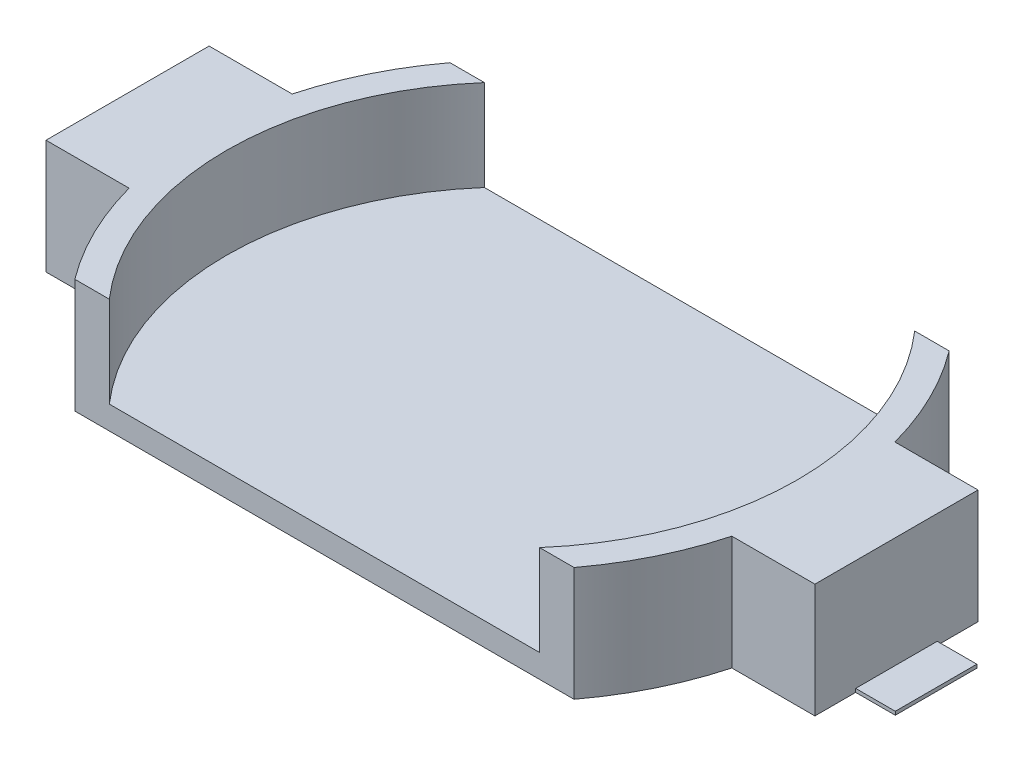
ISO-10303-21;
HEADER;
FILE_DESCRIPTION(('STEP AP214'),'2;1');
FILE_NAME('part.step','',(''),(''),'','','');
FILE_SCHEMA(('AUTOMOTIVE_DESIGN { 1 0 10303 214 1 1 1 1 }'));
ENDSEC;
DATA;
#1=APPLICATION_CONTEXT('core data for automotive mechanical design processes');
#2=APPLICATION_PROTOCOL_DEFINITION('international standard','automotive_design',2000,#1);
#3=PRODUCT_CONTEXT('',#1,'mechanical');
#4=PRODUCT('Part','Part','',(#3));
#5=PRODUCT_RELATED_PRODUCT_CATEGORY('part','',(#4));
#6=PRODUCT_DEFINITION_FORMATION('','',#4);
#7=PRODUCT_DEFINITION_CONTEXT('part definition',#1,'design');
#8=PRODUCT_DEFINITION('design','',#6,#7);
#9=PRODUCT_DEFINITION_SHAPE('','',#8);
#10=(LENGTH_UNIT() NAMED_UNIT(*) SI_UNIT(.MILLI.,.METRE.));
#11=(NAMED_UNIT(*) PLANE_ANGLE_UNIT() SI_UNIT($,.RADIAN.));
#12=(NAMED_UNIT(*) SI_UNIT($,.STERADIAN.) SOLID_ANGLE_UNIT());
#13=UNCERTAINTY_MEASURE_WITH_UNIT(LENGTH_MEASURE(1.E-05),#10,'distance_accuracy_value','');
#14=(GEOMETRIC_REPRESENTATION_CONTEXT(3) GLOBAL_UNCERTAINTY_ASSIGNED_CONTEXT((#13)) GLOBAL_UNIT_ASSIGNED_CONTEXT((#10,
#11,#12)) REPRESENTATION_CONTEXT('',''));
#15=CARTESIAN_POINT('',(0.,0.,0.));
#16=DIRECTION('',(0.,0.,1.));
#17=DIRECTION('',(1.,0.,0.));
#18=AXIS2_PLACEMENT_3D('',#15,#16,#17);
#19=CARTESIAN_POINT('',(0.,4.9,0.));
#20=DIRECTION('',(0.,-1.,0.));
#21=DIRECTION('',(0.,0.,-1.));
#22=AXIS2_PLACEMENT_3D('',#19,#20,#21);
#23=CYLINDRICAL_SURFACE('',#22,13.4);
#24=CARTESIAN_POINT('',(0.,4.9,0.));
#25=DIRECTION('',(0.,1.,0.));
#26=DIRECTION('',(0.,0.,1.));
#27=AXIS2_PLACEMENT_3D('',#24,#25,#26);
#28=CIRCLE('',#27,13.4);
#29=CARTESIAN_POINT('',(12.9348366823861,4.9,-3.5));
#30=VERTEX_POINT('',#29);
#31=CARTESIAN_POINT('',(10.7124927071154,4.9,-8.05));
#32=VERTEX_POINT('',#31);
#33=EDGE_CURVE('E357',#30,#32,#28,.T.);
#34=ORIENTED_EDGE('',*,*,#33,.F.);
#35=DIRECTION('',(0.,-1.,0.));
#36=VECTOR('',#35,1.);
#37=CARTESIAN_POINT('',(12.9348366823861,4.9,-3.5));
#38=LINE('',#37,#36);
#39=CARTESIAN_POINT('',(12.9348366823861,0.,-3.5));
#40=VERTEX_POINT('',#39);
#41=EDGE_CURVE('E322',#30,#40,#38,.T.);
#42=ORIENTED_EDGE('',*,*,#41,.T.);
#43=CARTESIAN_POINT('',(0.,0.,0.));
#44=DIRECTION('',(0.,1.,0.));
#45=DIRECTION('',(0.,0.,1.));
#46=AXIS2_PLACEMENT_3D('',#43,#44,#45);
#47=CIRCLE('',#46,13.4);
#48=CARTESIAN_POINT('',(10.7124927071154,0.,-8.05));
#49=VERTEX_POINT('',#48);
#50=EDGE_CURVE('E353',#40,#49,#47,.T.);
#51=ORIENTED_EDGE('',*,*,#50,.T.);
#52=DIRECTION('',(0.,-1.,0.));
#53=VECTOR('',#52,1.);
#54=CARTESIAN_POINT('',(10.7124927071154,4.9,-8.05));
#55=LINE('',#54,#53);
#56=EDGE_CURVE('E370',#32,#49,#55,.T.);
#57=ORIENTED_EDGE('',*,*,#56,.F.);
#58=EDGE_LOOP('',(#34,#42,#51,#57));
#59=FACE_BOUND('',#58,.T.);
#60=ADVANCED_FACE('F31',(#59),#23,.T.);
#61=CARTESIAN_POINT('',(-12.9348366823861,4.9,3.50000000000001));
#62=VERTEX_POINT('',#61);
#63=CARTESIAN_POINT('',(-10.7124927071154,4.9,8.05));
#64=VERTEX_POINT('',#63);
#65=EDGE_CURVE('E352',#62,#64,#28,.T.);
#66=ORIENTED_EDGE('',*,*,#65,.F.);
#67=DIRECTION('',(0.,-1.,0.));
#68=VECTOR('',#67,1.);
#69=CARTESIAN_POINT('',(-12.9348366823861,4.9,3.5));
#70=LINE('',#69,#68);
#71=CARTESIAN_POINT('',(-12.9348366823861,0.,3.5));
#72=VERTEX_POINT('',#71);
#73=EDGE_CURVE('E403',#62,#72,#70,.T.);
#74=ORIENTED_EDGE('',*,*,#73,.T.);
#75=CARTESIAN_POINT('',(-10.7124927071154,0.,8.05));
#76=VERTEX_POINT('',#75);
#77=EDGE_CURVE('E367',#72,#76,#47,.T.);
#78=ORIENTED_EDGE('',*,*,#77,.T.);
#79=DIRECTION('',(0.,-1.,0.));
#80=VECTOR('',#79,1.);
#81=CARTESIAN_POINT('',(-10.7124927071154,4.9,8.05));
#82=LINE('',#81,#80);
#83=EDGE_CURVE('E385',#64,#76,#82,.T.);
#84=ORIENTED_EDGE('',*,*,#83,.F.);
#85=EDGE_LOOP('',(#66,#74,#78,#84));
#86=FACE_BOUND('',#85,.T.);
#87=ADVANCED_FACE('F433',(#86),#23,.T.);
#88=CARTESIAN_POINT('',(10.7124927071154,0.,8.05));
#89=VERTEX_POINT('',#88);
#90=CARTESIAN_POINT('',(12.9348366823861,0.,3.5));
#91=VERTEX_POINT('',#90);
#92=EDGE_CURVE('E350',#89,#91,#47,.T.);
#93=ORIENTED_EDGE('',*,*,#92,.T.);
#94=DIRECTION('',(0.,-1.,0.));
#95=VECTOR('',#94,1.);
#96=CARTESIAN_POINT('',(12.9348366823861,4.9,3.5));
#97=LINE('',#96,#95);
#98=CARTESIAN_POINT('',(12.9348366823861,4.9,3.5));
#99=VERTEX_POINT('',#98);
#100=EDGE_CURVE('E327',#99,#91,#97,.T.);
#101=ORIENTED_EDGE('',*,*,#100,.F.);
#102=CARTESIAN_POINT('',(10.7124927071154,4.9,8.05));
#103=VERTEX_POINT('',#102);
#104=EDGE_CURVE('E349',#103,#99,#28,.T.);
#105=ORIENTED_EDGE('',*,*,#104,.F.);
#106=DIRECTION('',(0.,-1.,0.));
#107=VECTOR('',#106,1.);
#108=CARTESIAN_POINT('',(10.7124927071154,4.9,8.05));
#109=LINE('',#108,#107);
#110=EDGE_CURVE('E388',#89,#103,#109,.F.);
#111=ORIENTED_EDGE('',*,*,#110,.F.);
#112=EDGE_LOOP('',(#93,#101,#105,#111));
#113=FACE_BOUND('',#112,.T.);
#114=ADVANCED_FACE('F33',(#113),#23,.T.);
#115=CARTESIAN_POINT('',(-10.7124927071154,0.,-8.05));
#116=VERTEX_POINT('',#115);
#117=CARTESIAN_POINT('',(-12.9348366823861,0.,-3.5));
#118=VERTEX_POINT('',#117);
#119=EDGE_CURVE('E354',#116,#118,#47,.T.);
#120=ORIENTED_EDGE('',*,*,#119,.T.);
#121=DIRECTION('',(0.,-1.,0.));
#122=VECTOR('',#121,1.);
#123=CARTESIAN_POINT('',(-12.9348366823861,4.9,-3.5));
#124=LINE('',#123,#122);
#125=CARTESIAN_POINT('',(-12.9348366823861,4.9,-3.5));
#126=VERTEX_POINT('',#125);
#127=EDGE_CURVE('E400',#126,#118,#124,.T.);
#128=ORIENTED_EDGE('',*,*,#127,.F.);
#129=CARTESIAN_POINT('',(-10.7124927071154,4.9,-8.05));
#130=VERTEX_POINT('',#129);
#131=EDGE_CURVE('E358',#130,#126,#28,.T.);
#132=ORIENTED_EDGE('',*,*,#131,.F.);
#133=DIRECTION('',(0.,-1.,0.));
#134=VECTOR('',#133,1.);
#135=CARTESIAN_POINT('',(-10.7124927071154,4.9,-8.05));
#136=LINE('',#135,#134);
#137=EDGE_CURVE('E373',#116,#130,#136,.F.);
#138=ORIENTED_EDGE('',*,*,#137,.F.);
#139=EDGE_LOOP('',(#120,#128,#132,#138));
#140=FACE_BOUND('',#139,.T.);
#141=ADVANCED_FACE('F416',(#140),#23,.T.);
#142=CARTESIAN_POINT('',(0.,4.9,0.));
#143=DIRECTION('',(0.,1.,0.));
#144=DIRECTION('',(0.,0.,1.));
#145=AXIS2_PLACEMENT_3D('',#142,#143,#144);
#146=PLANE('',#145);
#147=ORIENTED_EDGE('',*,*,#104,.T.);
#148=DIRECTION('',(-1.,0.,0.));
#149=VECTOR('',#148,1.);
#150=CARTESIAN_POINT('',(16.5,4.9,3.5));
#151=LINE('',#150,#149);
#152=CARTESIAN_POINT('',(16.5,4.9,3.5));
#153=VERTEX_POINT('',#152);
#154=EDGE_CURVE('E268',#153,#99,#151,.T.);
#155=ORIENTED_EDGE('',*,*,#154,.F.);
#156=DIRECTION('',(0.,0.,1.));
#157=VECTOR('',#156,1.);
#158=CARTESIAN_POINT('',(16.5,4.9,3.5));
#159=LINE('',#158,#157);
#160=CARTESIAN_POINT('',(16.5,4.9,-3.5));
#161=VERTEX_POINT('',#160);
#162=EDGE_CURVE('E265',#161,#153,#159,.T.);
#163=ORIENTED_EDGE('',*,*,#162,.F.);
#164=DIRECTION('',(1.,0.,0.));
#165=VECTOR('',#164,1.);
#166=CARTESIAN_POINT('',(16.5,4.9,-3.5));
#167=LINE('',#166,#165);
#168=EDGE_CURVE('E272',#30,#161,#167,.T.);
#169=ORIENTED_EDGE('',*,*,#168,.F.);
#170=ORIENTED_EDGE('',*,*,#33,.T.);
#171=DIRECTION('',(-1.,0.,0.));
#172=VECTOR('',#171,1.);
#173=CARTESIAN_POINT('',(0.,4.9,-8.05));
#174=LINE('',#173,#172);
#175=CARTESIAN_POINT('',(9.23363417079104,4.9,-8.05));
#176=VERTEX_POINT('',#175);
#177=EDGE_CURVE('E375',#32,#176,#174,.T.);
#178=ORIENTED_EDGE('',*,*,#177,.T.);
#179=CARTESIAN_POINT('',(0.,4.9,0.));
#180=DIRECTION('',(0.,1.,0.));
#181=DIRECTION('',(0.,0.,1.));
#182=AXIS2_PLACEMENT_3D('',#179,#180,#181);
#183=CIRCLE('',#182,12.25);
#184=CARTESIAN_POINT('',(9.23363417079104,4.9,8.05));
#185=VERTEX_POINT('',#184);
#186=EDGE_CURVE('E359',#185,#176,#183,.T.);
#187=ORIENTED_EDGE('',*,*,#186,.F.);
#188=DIRECTION('',(1.,0.,0.));
#189=VECTOR('',#188,1.);
#190=CARTESIAN_POINT('',(0.,4.9,8.05));
#191=LINE('',#190,#189);
#192=EDGE_CURVE('E391',#185,#103,#191,.T.);
#193=ORIENTED_EDGE('',*,*,#192,.T.);
#194=EDGE_LOOP('',(#147,#155,#163,#169,#170,#178,#187,#193));
#195=FACE_BOUND('',#194,.T.);
#196=ADVANCED_FACE('F445',(#195),#146,.T.);
#197=ORIENTED_EDGE('',*,*,#131,.T.);
#198=DIRECTION('',(1.,0.,0.));
#199=VECTOR('',#198,1.);
#200=CARTESIAN_POINT('',(-16.5,4.9,-3.5));
#201=LINE('',#200,#199);
#202=CARTESIAN_POINT('',(-16.5,4.9,-3.5));
#203=VERTEX_POINT('',#202);
#204=EDGE_CURVE('E336',#203,#126,#201,.T.);
#205=ORIENTED_EDGE('',*,*,#204,.F.);
#206=DIRECTION('',(0.,0.,-1.));
#207=VECTOR('',#206,1.);
#208=CARTESIAN_POINT('',(-16.5,4.9,3.5));
#209=LINE('',#208,#207);
#210=CARTESIAN_POINT('',(-16.5,4.9,3.5));
#211=VERTEX_POINT('',#210);
#212=EDGE_CURVE('E334',#211,#203,#209,.T.);
#213=ORIENTED_EDGE('',*,*,#212,.F.);
#214=DIRECTION('',(-1.,0.,0.));
#215=VECTOR('',#214,1.);
#216=CARTESIAN_POINT('',(-16.5,4.9,3.5));
#217=LINE('',#216,#215);
#218=EDGE_CURVE('E340',#62,#211,#217,.T.);
#219=ORIENTED_EDGE('',*,*,#218,.F.);
#220=ORIENTED_EDGE('',*,*,#65,.T.);
#221=CARTESIAN_POINT('',(-9.23363417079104,4.9,8.05));
#222=VERTEX_POINT('',#221);
#223=EDGE_CURVE('E390',#64,#222,#191,.T.);
#224=ORIENTED_EDGE('',*,*,#223,.T.);
#225=CARTESIAN_POINT('',(-9.23363417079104,4.9,-8.05));
#226=VERTEX_POINT('',#225);
#227=EDGE_CURVE('E363',#226,#222,#183,.T.);
#228=ORIENTED_EDGE('',*,*,#227,.F.);
#229=EDGE_CURVE('E376',#226,#130,#174,.T.);
#230=ORIENTED_EDGE('',*,*,#229,.T.);
#231=EDGE_LOOP('',(#197,#205,#213,#219,#220,#224,#228,#230));
#232=FACE_BOUND('',#231,.T.);
#233=ADVANCED_FACE('F419',(#232),#146,.T.);
#234=CARTESIAN_POINT('',(0.,0.,0.));
#235=DIRECTION('',(0.,1.,0.));
#236=DIRECTION('',(0.,0.,1.));
#237=AXIS2_PLACEMENT_3D('',#234,#235,#236);
#238=PLANE('',#237);
#239=ORIENTED_EDGE('',*,*,#50,.F.);
#240=DIRECTION('',(1.,0.,0.));
#241=VECTOR('',#240,1.);
#242=CARTESIAN_POINT('',(16.5,0.,-3.5));
#243=LINE('',#242,#241);
#244=CARTESIAN_POINT('',(16.5,0.,-3.5));
#245=VERTEX_POINT('',#244);
#246=EDGE_CURVE('E269',#40,#245,#243,.T.);
#247=ORIENTED_EDGE('',*,*,#246,.T.);
#248=DIRECTION('',(0.,0.,1.));
#249=VECTOR('',#248,1.);
#250=CARTESIAN_POINT('',(16.5,0.,3.5));
#251=LINE('',#250,#249);
#252=CARTESIAN_POINT('',(16.5,0.,-1.75));
#253=VERTEX_POINT('',#252);
#254=EDGE_CURVE('E284',#245,#253,#251,.T.);
#255=ORIENTED_EDGE('',*,*,#254,.T.);
#256=DIRECTION('',(1.,0.,0.));
#257=VECTOR('',#256,1.);
#258=CARTESIAN_POINT('',(16.5,0.,-1.75));
#259=LINE('',#258,#257);
#260=CARTESIAN_POINT('',(18.2,0.,-1.75));
#261=VERTEX_POINT('',#260);
#262=EDGE_CURVE('E48',#253,#261,#259,.T.);
#263=ORIENTED_EDGE('',*,*,#262,.T.);
#264=DIRECTION('',(0.,0.,1.));
#265=VECTOR('',#264,1.);
#266=CARTESIAN_POINT('',(18.2,0.,1.75));
#267=LINE('',#266,#265);
#268=CARTESIAN_POINT('',(18.2,0.,1.75));
#269=VERTEX_POINT('',#268);
#270=EDGE_CURVE('E219',#261,#269,#267,.T.);
#271=ORIENTED_EDGE('',*,*,#270,.T.);
#272=DIRECTION('',(-1.,0.,0.));
#273=VECTOR('',#272,1.);
#274=CARTESIAN_POINT('',(16.5,0.,1.75));
#275=LINE('',#274,#273);
#276=CARTESIAN_POINT('',(16.5,0.,1.75));
#277=VERTEX_POINT('',#276);
#278=EDGE_CURVE('E216',#269,#277,#275,.T.);
#279=ORIENTED_EDGE('',*,*,#278,.T.);
#280=CARTESIAN_POINT('',(16.5,0.,3.5));
#281=VERTEX_POINT('',#280);
#282=EDGE_CURVE('E282',#277,#281,#251,.T.);
#283=ORIENTED_EDGE('',*,*,#282,.T.);
#284=DIRECTION('',(-1.,0.,0.));
#285=VECTOR('',#284,1.);
#286=CARTESIAN_POINT('',(16.5,0.,3.5));
#287=LINE('',#286,#285);
#288=EDGE_CURVE('E278',#281,#91,#287,.T.);
#289=ORIENTED_EDGE('',*,*,#288,.T.);
#290=ORIENTED_EDGE('',*,*,#92,.F.);
#291=DIRECTION('',(1.,0.,0.));
#292=VECTOR('',#291,1.);
#293=CARTESIAN_POINT('',(0.,0.,8.05));
#294=LINE('',#293,#292);
#295=EDGE_CURVE('E383',#76,#89,#294,.T.);
#296=ORIENTED_EDGE('',*,*,#295,.F.);
#297=ORIENTED_EDGE('',*,*,#77,.F.);
#298=DIRECTION('',(-1.,0.,0.));
#299=VECTOR('',#298,1.);
#300=CARTESIAN_POINT('',(-16.5,0.,3.5));
#301=LINE('',#300,#299);
#302=CARTESIAN_POINT('',(-16.5,0.,3.5));
#303=VERTEX_POINT('',#302);
#304=EDGE_CURVE('E337',#72,#303,#301,.T.);
#305=ORIENTED_EDGE('',*,*,#304,.T.);
#306=DIRECTION('',(0.,0.,-1.));
#307=VECTOR('',#306,1.);
#308=CARTESIAN_POINT('',(-16.5,0.,3.5));
#309=LINE('',#308,#307);
#310=CARTESIAN_POINT('',(-16.5,0.,1.75));
#311=VERTEX_POINT('',#310);
#312=EDGE_CURVE('E319',#303,#311,#309,.T.);
#313=ORIENTED_EDGE('',*,*,#312,.T.);
#314=DIRECTION('',(-1.,0.,0.));
#315=VECTOR('',#314,1.);
#316=CARTESIAN_POINT('',(-16.5,0.,1.75));
#317=LINE('',#316,#315);
#318=CARTESIAN_POINT('',(-18.2,0.,1.75));
#319=VERTEX_POINT('',#318);
#320=EDGE_CURVE('E56',#311,#319,#317,.T.);
#321=ORIENTED_EDGE('',*,*,#320,.T.);
#322=DIRECTION('',(0.,0.,-1.));
#323=VECTOR('',#322,1.);
#324=CARTESIAN_POINT('',(-18.2,0.,1.75));
#325=LINE('',#324,#323);
#326=CARTESIAN_POINT('',(-18.2,0.,-1.75));
#327=VERTEX_POINT('',#326);
#328=EDGE_CURVE('E240',#319,#327,#325,.T.);
#329=ORIENTED_EDGE('',*,*,#328,.T.);
#330=DIRECTION('',(1.,0.,0.));
#331=VECTOR('',#330,1.);
#332=CARTESIAN_POINT('',(-16.5,0.,-1.75));
#333=LINE('',#332,#331);
#334=CARTESIAN_POINT('',(-16.5,0.,-1.75));
#335=VERTEX_POINT('',#334);
#336=EDGE_CURVE('E245',#327,#335,#333,.T.);
#337=ORIENTED_EDGE('',*,*,#336,.T.);
#338=CARTESIAN_POINT('',(-16.5,0.,-3.5));
#339=VERTEX_POINT('',#338);
#340=EDGE_CURVE('E249',#335,#339,#309,.T.);
#341=ORIENTED_EDGE('',*,*,#340,.T.);
#342=DIRECTION('',(1.,0.,0.));
#343=VECTOR('',#342,1.);
#344=CARTESIAN_POINT('',(-16.5,0.,-3.5));
#345=LINE('',#344,#343);
#346=EDGE_CURVE('E321',#339,#118,#345,.T.);
#347=ORIENTED_EDGE('',*,*,#346,.T.);
#348=ORIENTED_EDGE('',*,*,#119,.F.);
#349=DIRECTION('',(-1.,0.,0.));
#350=VECTOR('',#349,1.);
#351=CARTESIAN_POINT('',(0.,0.,-8.05));
#352=LINE('',#351,#350);
#353=EDGE_CURVE('E368',#49,#116,#352,.T.);
#354=ORIENTED_EDGE('',*,*,#353,.F.);
#355=EDGE_LOOP('',(#239,#247,#255,#263,#271,#279,#283,#289,#290,#296,#297,#305,#313,#321,#329,
#337,#341,#347,#348,#354));
#356=FACE_BOUND('',#355,.T.);
#357=ADVANCED_FACE('F309',(#356),#238,.F.);
#358=CARTESIAN_POINT('',(0.,1.,0.));
#359=DIRECTION('',(0.,1.,0.));
#360=DIRECTION('',(0.,0.,1.));
#361=AXIS2_PLACEMENT_3D('',#358,#359,#360);
#362=CYLINDRICAL_SURFACE('',#361,12.25);
#363=DIRECTION('',(0.,1.,0.));
#364=VECTOR('',#363,1.);
#365=CARTESIAN_POINT('',(-9.23363417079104,1.,-8.05));
#366=LINE('',#365,#364);
#367=CARTESIAN_POINT('',(-9.23363417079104,1.,-8.05));
#368=VERTEX_POINT('',#367);
#369=EDGE_CURVE('E379',#226,#368,#366,.F.);
#370=ORIENTED_EDGE('',*,*,#369,.F.);
#371=ORIENTED_EDGE('',*,*,#227,.T.);
#372=DIRECTION('',(0.,1.,0.));
#373=VECTOR('',#372,1.);
#374=CARTESIAN_POINT('',(-9.23363417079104,1.,8.05));
#375=LINE('',#374,#373);
#376=CARTESIAN_POINT('',(-9.23363417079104,1.,8.05));
#377=VERTEX_POINT('',#376);
#378=EDGE_CURVE('E396',#377,#222,#375,.T.);
#379=ORIENTED_EDGE('',*,*,#378,.F.);
#380=CARTESIAN_POINT('',(0.,1.,0.));
#381=DIRECTION('',(0.,1.,0.));
#382=DIRECTION('',(0.,0.,1.));
#383=AXIS2_PLACEMENT_3D('',#380,#381,#382);
#384=CIRCLE('',#383,12.25);
#385=EDGE_CURVE('E362',#368,#377,#384,.T.);
#386=ORIENTED_EDGE('',*,*,#385,.F.);
#387=EDGE_LOOP('',(#370,#371,#379,#386));
#388=FACE_BOUND('',#387,.T.);
#389=ADVANCED_FACE('F457',(#388),#362,.F.);
#390=DIRECTION('',(0.,1.,0.));
#391=VECTOR('',#390,1.);
#392=CARTESIAN_POINT('',(9.23363417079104,1.,-8.05));
#393=LINE('',#392,#391);
#394=CARTESIAN_POINT('',(9.23363417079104,1.,-8.05));
#395=VERTEX_POINT('',#394);
#396=EDGE_CURVE('E381',#395,#176,#393,.T.);
#397=ORIENTED_EDGE('',*,*,#396,.F.);
#398=CARTESIAN_POINT('',(9.23363417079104,1.,8.05));
#399=VERTEX_POINT('',#398);
#400=EDGE_CURVE('E364',#399,#395,#384,.T.);
#401=ORIENTED_EDGE('',*,*,#400,.F.);
#402=DIRECTION('',(0.,1.,0.));
#403=VECTOR('',#402,1.);
#404=CARTESIAN_POINT('',(9.23363417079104,1.,8.05));
#405=LINE('',#404,#403);
#406=EDGE_CURVE('E394',#185,#399,#405,.F.);
#407=ORIENTED_EDGE('',*,*,#406,.F.);
#408=ORIENTED_EDGE('',*,*,#186,.T.);
#409=EDGE_LOOP('',(#397,#401,#407,#408));
#410=FACE_BOUND('',#409,.T.);
#411=ADVANCED_FACE('F449',(#410),#362,.F.);
#412=CARTESIAN_POINT('',(0.,1.,0.));
#413=DIRECTION('',(0.,1.,0.));
#414=DIRECTION('',(0.,0.,1.));
#415=AXIS2_PLACEMENT_3D('',#412,#413,#414);
#416=PLANE('',#415);
#417=ORIENTED_EDGE('',*,*,#400,.T.);
#418=DIRECTION('',(-1.,0.,0.));
#419=VECTOR('',#418,1.);
#420=CARTESIAN_POINT('',(0.,1.,-8.05));
#421=LINE('',#420,#419);
#422=EDGE_CURVE('E12',#395,#368,#421,.T.);
#423=ORIENTED_EDGE('',*,*,#422,.T.);
#424=ORIENTED_EDGE('',*,*,#385,.T.);
#425=DIRECTION('',(1.,0.,0.));
#426=VECTOR('',#425,1.);
#427=CARTESIAN_POINT('',(0.,1.,8.05));
#428=LINE('',#427,#426);
#429=EDGE_CURVE('E40',#377,#399,#428,.T.);
#430=ORIENTED_EDGE('',*,*,#429,.T.);
#431=EDGE_LOOP('',(#417,#423,#424,#430));
#432=FACE_BOUND('',#431,.T.);
#433=ADVANCED_FACE('F453',(#432),#416,.T.);
#434=CARTESIAN_POINT('',(-24.8556813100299,-11.45,8.05));
#435=DIRECTION('',(0.,0.,1.));
#436=DIRECTION('',(1.,0.,0.));
#437=AXIS2_PLACEMENT_3D('',#434,#435,#436);
#438=PLANE('',#437);
#439=ORIENTED_EDGE('',*,*,#295,.T.);
#440=ORIENTED_EDGE('',*,*,#110,.T.);
#441=ORIENTED_EDGE('',*,*,#192,.F.);
#442=ORIENTED_EDGE('',*,*,#406,.T.);
#443=ORIENTED_EDGE('',*,*,#429,.F.);
#444=ORIENTED_EDGE('',*,*,#378,.T.);
#445=ORIENTED_EDGE('',*,*,#223,.F.);
#446=ORIENTED_EDGE('',*,*,#83,.T.);
#447=EDGE_LOOP('',(#439,#440,#441,#442,#443,#444,#445,#446));
#448=FACE_BOUND('',#447,.T.);
#449=ADVANCED_FACE('F430',(#448),#438,.T.);
#450=CARTESIAN_POINT('',(-24.8556813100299,-11.45,-8.05));
#451=DIRECTION('',(0.,0.,-1.));
#452=DIRECTION('',(-1.,0.,0.));
#453=AXIS2_PLACEMENT_3D('',#450,#451,#452);
#454=PLANE('',#453);
#455=ORIENTED_EDGE('',*,*,#353,.T.);
#456=ORIENTED_EDGE('',*,*,#137,.T.);
#457=ORIENTED_EDGE('',*,*,#229,.F.);
#458=ORIENTED_EDGE('',*,*,#369,.T.);
#459=ORIENTED_EDGE('',*,*,#422,.F.);
#460=ORIENTED_EDGE('',*,*,#396,.T.);
#461=ORIENTED_EDGE('',*,*,#177,.F.);
#462=ORIENTED_EDGE('',*,*,#56,.T.);
#463=EDGE_LOOP('',(#455,#456,#457,#458,#459,#460,#461,#462));
#464=FACE_BOUND('',#463,.T.);
#465=ADVANCED_FACE('F440',(#464),#454,.T.);
#466=CARTESIAN_POINT('',(-16.5,4.9,3.5));
#467=DIRECTION('',(-1.,0.,0.));
#468=DIRECTION('',(0.,0.,1.));
#469=AXIS2_PLACEMENT_3D('',#466,#467,#468);
#470=PLANE('',#469);
#471=DIRECTION('',(0.,-1.,0.));
#472=VECTOR('',#471,1.);
#473=CARTESIAN_POINT('',(-16.5,0.15,-1.75));
#474=LINE('',#473,#472);
#475=CARTESIAN_POINT('',(-16.5,0.15,-1.75));
#476=VERTEX_POINT('',#475);
#477=EDGE_CURVE('E259',#476,#335,#474,.T.);
#478=ORIENTED_EDGE('',*,*,#477,.F.);
#479=DIRECTION('',(0.,0.,1.));
#480=VECTOR('',#479,1.);
#481=CARTESIAN_POINT('',(-16.5,0.15,1.75));
#482=LINE('',#481,#480);
#483=CARTESIAN_POINT('',(-16.5,0.15,1.75));
#484=VERTEX_POINT('',#483);
#485=EDGE_CURVE('E230',#476,#484,#482,.T.);
#486=ORIENTED_EDGE('',*,*,#485,.T.);
#487=DIRECTION('',(0.,-1.,0.));
#488=VECTOR('',#487,1.);
#489=CARTESIAN_POINT('',(-16.5,0.15,1.75));
#490=LINE('',#489,#488);
#491=EDGE_CURVE('E254',#484,#311,#490,.T.);
#492=ORIENTED_EDGE('',*,*,#491,.T.);
#493=ORIENTED_EDGE('',*,*,#312,.F.);
#494=DIRECTION('',(0.,-1.,0.));
#495=VECTOR('',#494,1.);
#496=CARTESIAN_POINT('',(-16.5,4.9,3.5));
#497=LINE('',#496,#495);
#498=EDGE_CURVE('E398',#211,#303,#497,.T.);
#499=ORIENTED_EDGE('',*,*,#498,.F.);
#500=ORIENTED_EDGE('',*,*,#212,.T.);
#501=DIRECTION('',(0.,-1.,0.));
#502=VECTOR('',#501,1.);
#503=CARTESIAN_POINT('',(-16.5,4.9,-3.5));
#504=LINE('',#503,#502);
#505=EDGE_CURVE('E316',#203,#339,#504,.T.);
#506=ORIENTED_EDGE('',*,*,#505,.T.);
#507=ORIENTED_EDGE('',*,*,#340,.F.);
#508=EDGE_LOOP('',(#478,#486,#492,#493,#499,#500,#506,#507));
#509=FACE_BOUND('',#508,.T.);
#510=ADVANCED_FACE('F313',(#509),#470,.T.);
#511=CARTESIAN_POINT('',(-16.5,4.9,3.5));
#512=DIRECTION('',(0.,0.,1.));
#513=DIRECTION('',(1.,0.,0.));
#514=AXIS2_PLACEMENT_3D('',#511,#512,#513);
#515=PLANE('',#514);
#516=ORIENTED_EDGE('',*,*,#304,.F.);
#517=ORIENTED_EDGE('',*,*,#73,.F.);
#518=ORIENTED_EDGE('',*,*,#218,.T.);
#519=ORIENTED_EDGE('',*,*,#498,.T.);
#520=EDGE_LOOP('',(#516,#517,#518,#519));
#521=FACE_BOUND('',#520,.T.);
#522=ADVANCED_FACE('F499',(#521),#515,.T.);
#523=CARTESIAN_POINT('',(-16.5,4.9,-3.5));
#524=DIRECTION('',(0.,0.,-1.));
#525=DIRECTION('',(-1.,0.,0.));
#526=AXIS2_PLACEMENT_3D('',#523,#524,#525);
#527=PLANE('',#526);
#528=ORIENTED_EDGE('',*,*,#346,.F.);
#529=ORIENTED_EDGE('',*,*,#505,.F.);
#530=ORIENTED_EDGE('',*,*,#204,.T.);
#531=ORIENTED_EDGE('',*,*,#127,.T.);
#532=EDGE_LOOP('',(#528,#529,#530,#531));
#533=FACE_BOUND('',#532,.T.);
#534=ADVANCED_FACE('F411',(#533),#527,.T.);
#535=CARTESIAN_POINT('',(16.5,4.9,3.5));
#536=DIRECTION('',(1.,0.,0.));
#537=DIRECTION('',(0.,0.,-1.));
#538=AXIS2_PLACEMENT_3D('',#535,#536,#537);
#539=PLANE('',#538);
#540=DIRECTION('',(0.,-1.,0.));
#541=VECTOR('',#540,1.);
#542=CARTESIAN_POINT('',(16.5,0.15,1.75));
#543=LINE('',#542,#541);
#544=CARTESIAN_POINT('',(16.5,0.15,1.75));
#545=VERTEX_POINT('',#544);
#546=EDGE_CURVE('E215',#545,#277,#543,.T.);
#547=ORIENTED_EDGE('',*,*,#546,.F.);
#548=DIRECTION('',(0.,0.,-1.));
#549=VECTOR('',#548,1.);
#550=CARTESIAN_POINT('',(16.5,0.15,1.75));
#551=LINE('',#550,#549);
#552=CARTESIAN_POINT('',(16.5,0.15,-1.75));
#553=VERTEX_POINT('',#552);
#554=EDGE_CURVE('E207',#545,#553,#551,.T.);
#555=ORIENTED_EDGE('',*,*,#554,.T.);
#556=DIRECTION('',(0.,-1.,0.));
#557=VECTOR('',#556,1.);
#558=CARTESIAN_POINT('',(16.5,0.15,-1.75));
#559=LINE('',#558,#557);
#560=EDGE_CURVE('E192',#553,#253,#559,.T.);
#561=ORIENTED_EDGE('',*,*,#560,.T.);
#562=ORIENTED_EDGE('',*,*,#254,.F.);
#563=DIRECTION('',(0.,-1.,0.));
#564=VECTOR('',#563,1.);
#565=CARTESIAN_POINT('',(16.5,4.9,-3.5));
#566=LINE('',#565,#564);
#567=EDGE_CURVE('E320',#161,#245,#566,.T.);
#568=ORIENTED_EDGE('',*,*,#567,.F.);
#569=ORIENTED_EDGE('',*,*,#162,.T.);
#570=DIRECTION('',(0.,-1.,0.));
#571=VECTOR('',#570,1.);
#572=CARTESIAN_POINT('',(16.5,4.9,3.5));
#573=LINE('',#572,#571);
#574=EDGE_CURVE('E275',#153,#281,#573,.T.);
#575=ORIENTED_EDGE('',*,*,#574,.T.);
#576=ORIENTED_EDGE('',*,*,#282,.F.);
#577=EDGE_LOOP('',(#547,#555,#561,#562,#568,#569,#575,#576));
#578=FACE_BOUND('',#577,.T.);
#579=ADVANCED_FACE('F213',(#578),#539,.T.);
#580=CARTESIAN_POINT('',(16.5,4.9,-3.5));
#581=DIRECTION('',(0.,0.,-1.));
#582=DIRECTION('',(-1.,0.,0.));
#583=AXIS2_PLACEMENT_3D('',#580,#581,#582);
#584=PLANE('',#583);
#585=ORIENTED_EDGE('',*,*,#246,.F.);
#586=ORIENTED_EDGE('',*,*,#41,.F.);
#587=ORIENTED_EDGE('',*,*,#168,.T.);
#588=ORIENTED_EDGE('',*,*,#567,.T.);
#589=EDGE_LOOP('',(#585,#586,#587,#588));
#590=FACE_BOUND('',#589,.T.);
#591=ADVANCED_FACE('F485',(#590),#584,.T.);
#592=CARTESIAN_POINT('',(16.5,4.9,3.5));
#593=DIRECTION('',(0.,0.,1.));
#594=DIRECTION('',(1.,0.,0.));
#595=AXIS2_PLACEMENT_3D('',#592,#593,#594);
#596=PLANE('',#595);
#597=ORIENTED_EDGE('',*,*,#288,.F.);
#598=ORIENTED_EDGE('',*,*,#574,.F.);
#599=ORIENTED_EDGE('',*,*,#154,.T.);
#600=ORIENTED_EDGE('',*,*,#100,.T.);
#601=EDGE_LOOP('',(#597,#598,#599,#600));
#602=FACE_BOUND('',#601,.T.);
#603=ADVANCED_FACE('F483',(#602),#596,.T.);
#604=CARTESIAN_POINT('',(-16.5,0.15,-1.75));
#605=DIRECTION('',(0.,0.,-1.));
#606=DIRECTION('',(-1.,0.,0.));
#607=AXIS2_PLACEMENT_3D('',#604,#605,#606);
#608=PLANE('',#607);
#609=ORIENTED_EDGE('',*,*,#336,.F.);
#610=DIRECTION('',(0.,-1.,0.));
#611=VECTOR('',#610,1.);
#612=CARTESIAN_POINT('',(-18.2,0.15,-1.75));
#613=LINE('',#612,#611);
#614=CARTESIAN_POINT('',(-18.2,0.15,-1.75));
#615=VERTEX_POINT('',#614);
#616=EDGE_CURVE('E303',#615,#327,#613,.T.);
#617=ORIENTED_EDGE('',*,*,#616,.F.);
#618=DIRECTION('',(1.,0.,0.));
#619=VECTOR('',#618,1.);
#620=CARTESIAN_POINT('',(-16.5,0.15,-1.75));
#621=LINE('',#620,#619);
#622=EDGE_CURVE('E258',#615,#476,#621,.T.);
#623=ORIENTED_EDGE('',*,*,#622,.T.);
#624=ORIENTED_EDGE('',*,*,#477,.T.);
#625=EDGE_LOOP('',(#609,#617,#623,#624));
#626=FACE_BOUND('',#625,.T.);
#627=ADVANCED_FACE('F311',(#626),#608,.T.);
#628=CARTESIAN_POINT('',(-18.2,0.15,1.75));
#629=DIRECTION('',(-1.,0.,0.));
#630=DIRECTION('',(0.,0.,1.));
#631=AXIS2_PLACEMENT_3D('',#628,#629,#630);
#632=PLANE('',#631);
#633=ORIENTED_EDGE('',*,*,#328,.F.);
#634=DIRECTION('',(0.,-1.,0.));
#635=VECTOR('',#634,1.);
#636=CARTESIAN_POINT('',(-18.2,0.15,1.75));
#637=LINE('',#636,#635);
#638=CARTESIAN_POINT('',(-18.2,0.15,1.75));
#639=VERTEX_POINT('',#638);
#640=EDGE_CURVE('E257',#639,#319,#637,.T.);
#641=ORIENTED_EDGE('',*,*,#640,.F.);
#642=DIRECTION('',(0.,0.,-1.));
#643=VECTOR('',#642,1.);
#644=CARTESIAN_POINT('',(-18.2,0.15,1.75));
#645=LINE('',#644,#643);
#646=EDGE_CURVE('E297',#639,#615,#645,.T.);
#647=ORIENTED_EDGE('',*,*,#646,.T.);
#648=ORIENTED_EDGE('',*,*,#616,.T.);
#649=EDGE_LOOP('',(#633,#641,#647,#648));
#650=FACE_BOUND('',#649,.T.);
#651=ADVANCED_FACE('F308',(#650),#632,.T.);
#652=CARTESIAN_POINT('',(-16.5,0.15,1.75));
#653=DIRECTION('',(0.,0.,1.));
#654=DIRECTION('',(1.,0.,0.));
#655=AXIS2_PLACEMENT_3D('',#652,#653,#654);
#656=PLANE('',#655);
#657=ORIENTED_EDGE('',*,*,#320,.F.);
#658=ORIENTED_EDGE('',*,*,#491,.F.);
#659=DIRECTION('',(-1.,0.,0.));
#660=VECTOR('',#659,1.);
#661=CARTESIAN_POINT('',(-16.5,0.15,1.75));
#662=LINE('',#661,#660);
#663=EDGE_CURVE('E293',#484,#639,#662,.T.);
#664=ORIENTED_EDGE('',*,*,#663,.T.);
#665=ORIENTED_EDGE('',*,*,#640,.T.);
#666=EDGE_LOOP('',(#657,#658,#664,#665));
#667=FACE_BOUND('',#666,.T.);
#668=ADVANCED_FACE('F306',(#667),#656,.T.);
#669=CARTESIAN_POINT('',(-16.5,0.15,-1.75));
#670=DIRECTION('',(0.,1.,0.));
#671=DIRECTION('',(0.,0.,1.));
#672=AXIS2_PLACEMENT_3D('',#669,#670,#671);
#673=PLANE('',#672);
#674=ORIENTED_EDGE('',*,*,#485,.F.);
#675=ORIENTED_EDGE('',*,*,#622,.F.);
#676=ORIENTED_EDGE('',*,*,#646,.F.);
#677=ORIENTED_EDGE('',*,*,#663,.F.);
#678=EDGE_LOOP('',(#674,#675,#676,#677));
#679=FACE_BOUND('',#678,.T.);
#680=ADVANCED_FACE('F586',(#679),#673,.T.);
#681=CARTESIAN_POINT('',(16.5,0.15,1.75));
#682=DIRECTION('',(0.,0.,1.));
#683=DIRECTION('',(1.,0.,0.));
#684=AXIS2_PLACEMENT_3D('',#681,#682,#683);
#685=PLANE('',#684);
#686=ORIENTED_EDGE('',*,*,#278,.F.);
#687=DIRECTION('',(0.,-1.,0.));
#688=VECTOR('',#687,1.);
#689=CARTESIAN_POINT('',(18.2,0.15,1.75));
#690=LINE('',#689,#688);
#691=CARTESIAN_POINT('',(18.2,0.15,1.75));
#692=VERTEX_POINT('',#691);
#693=EDGE_CURVE('E225',#692,#269,#690,.T.);
#694=ORIENTED_EDGE('',*,*,#693,.F.);
#695=DIRECTION('',(-1.,0.,0.));
#696=VECTOR('',#695,1.);
#697=CARTESIAN_POINT('',(16.5,0.15,1.75));
#698=LINE('',#697,#696);
#699=EDGE_CURVE('E201',#692,#545,#698,.T.);
#700=ORIENTED_EDGE('',*,*,#699,.T.);
#701=ORIENTED_EDGE('',*,*,#546,.T.);
#702=EDGE_LOOP('',(#686,#694,#700,#701));
#703=FACE_BOUND('',#702,.T.);
#704=ADVANCED_FACE('F594',(#703),#685,.T.);
#705=CARTESIAN_POINT('',(18.2,0.15,1.75));
#706=DIRECTION('',(1.,0.,0.));
#707=DIRECTION('',(0.,0.,-1.));
#708=AXIS2_PLACEMENT_3D('',#705,#706,#707);
#709=PLANE('',#708);
#710=ORIENTED_EDGE('',*,*,#270,.F.);
#711=DIRECTION('',(0.,-1.,0.));
#712=VECTOR('',#711,1.);
#713=CARTESIAN_POINT('',(18.2,0.15,-1.75));
#714=LINE('',#713,#712);
#715=CARTESIAN_POINT('',(18.2,0.15,-1.75));
#716=VERTEX_POINT('',#715);
#717=EDGE_CURVE('E200',#716,#261,#714,.T.);
#718=ORIENTED_EDGE('',*,*,#717,.F.);
#719=DIRECTION('',(0.,0.,1.));
#720=VECTOR('',#719,1.);
#721=CARTESIAN_POINT('',(18.2,0.15,1.75));
#722=LINE('',#721,#720);
#723=EDGE_CURVE('E210',#716,#692,#722,.T.);
#724=ORIENTED_EDGE('',*,*,#723,.T.);
#725=ORIENTED_EDGE('',*,*,#693,.T.);
#726=EDGE_LOOP('',(#710,#718,#724,#725));
#727=FACE_BOUND('',#726,.T.);
#728=ADVANCED_FACE('F604',(#727),#709,.T.);
#729=CARTESIAN_POINT('',(16.5,0.15,-1.75));
#730=DIRECTION('',(0.,0.,-1.));
#731=DIRECTION('',(-1.,0.,0.));
#732=AXIS2_PLACEMENT_3D('',#729,#730,#731);
#733=PLANE('',#732);
#734=ORIENTED_EDGE('',*,*,#262,.F.);
#735=ORIENTED_EDGE('',*,*,#560,.F.);
#736=DIRECTION('',(1.,0.,0.));
#737=VECTOR('',#736,1.);
#738=CARTESIAN_POINT('',(16.5,0.15,-1.75));
#739=LINE('',#738,#737);
#740=EDGE_CURVE('E195',#553,#716,#739,.T.);
#741=ORIENTED_EDGE('',*,*,#740,.T.);
#742=ORIENTED_EDGE('',*,*,#717,.T.);
#743=EDGE_LOOP('',(#734,#735,#741,#742));
#744=FACE_BOUND('',#743,.T.);
#745=ADVANCED_FACE('F194',(#744),#733,.T.);
#746=CARTESIAN_POINT('',(16.5,0.15,-1.75));
#747=DIRECTION('',(0.,-1.,0.));
#748=DIRECTION('',(0.,0.,-1.));
#749=AXIS2_PLACEMENT_3D('',#746,#747,#748);
#750=PLANE('',#749);
#751=ORIENTED_EDGE('',*,*,#554,.F.);
#752=ORIENTED_EDGE('',*,*,#699,.F.);
#753=ORIENTED_EDGE('',*,*,#723,.F.);
#754=ORIENTED_EDGE('',*,*,#740,.F.);
#755=EDGE_LOOP('',(#751,#752,#753,#754));
#756=FACE_BOUND('',#755,.T.);
#757=ADVANCED_FACE('F205',(#756),#750,.F.);
#758=CLOSED_SHELL('',(#60,#87,#114,#141,#196,#233,#357,#389,#411,#433,#449,#465,#510,#522,#534,
#579,#591,#603,#627,#651,#668,#680,#704,#728,#745,#757));
#759=MANIFOLD_SOLID_BREP('B2',#758);
#760=ADVANCED_BREP_SHAPE_REPRESENTATION('',(#18,#759),#14);
#761=SHAPE_DEFINITION_REPRESENTATION(#9,#760);
ENDSEC;
END-ISO-10303-21;
